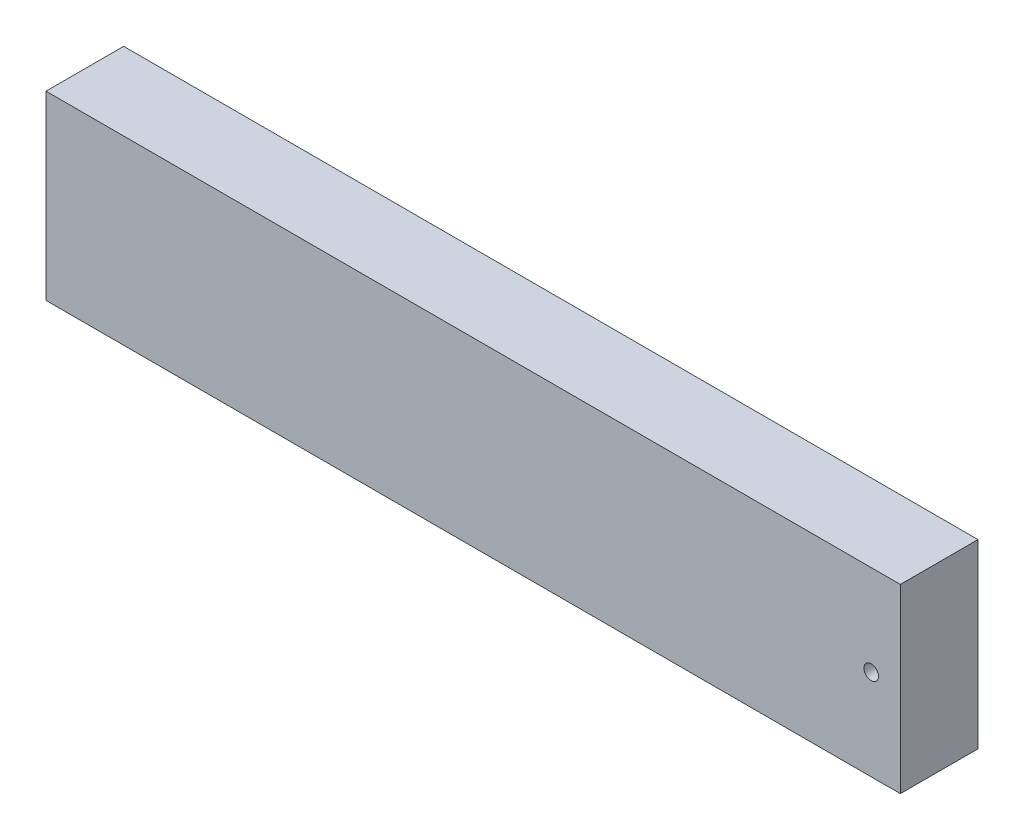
ISO-10303-21;
HEADER;
FILE_DESCRIPTION(('STEP AP214'),'2;1');
FILE_NAME('part.step','',(''),(''),'','','');
FILE_SCHEMA(('AUTOMOTIVE_DESIGN { 1 0 10303 214 1 1 1 1 }'));
ENDSEC;
DATA;
#1=APPLICATION_CONTEXT('core data for automotive mechanical design processes');
#2=APPLICATION_PROTOCOL_DEFINITION('international standard','automotive_design',2000,#1);
#3=PRODUCT_CONTEXT('',#1,'mechanical');
#4=PRODUCT('Part','Part','',(#3));
#5=PRODUCT_RELATED_PRODUCT_CATEGORY('part','',(#4));
#6=PRODUCT_DEFINITION_FORMATION('','',#4);
#7=PRODUCT_DEFINITION_CONTEXT('part definition',#1,'design');
#8=PRODUCT_DEFINITION('design','',#6,#7);
#9=PRODUCT_DEFINITION_SHAPE('','',#8);
#10=(LENGTH_UNIT() NAMED_UNIT(*) SI_UNIT(.MILLI.,.METRE.));
#11=(NAMED_UNIT(*) PLANE_ANGLE_UNIT() SI_UNIT($,.RADIAN.));
#12=(NAMED_UNIT(*) SI_UNIT($,.STERADIAN.) SOLID_ANGLE_UNIT());
#13=UNCERTAINTY_MEASURE_WITH_UNIT(LENGTH_MEASURE(1.E-05),#10,'distance_accuracy_value','');
#14=(GEOMETRIC_REPRESENTATION_CONTEXT(3) GLOBAL_UNCERTAINTY_ASSIGNED_CONTEXT((#13)) GLOBAL_UNIT_ASSIGNED_CONTEXT((#10,
#11,#12)) REPRESENTATION_CONTEXT('',''));
#15=CARTESIAN_POINT('',(0.,0.,0.));
#16=DIRECTION('',(0.,0.,1.));
#17=DIRECTION('',(1.,0.,0.));
#18=AXIS2_PLACEMENT_3D('',#15,#16,#17);
#19=CARTESIAN_POINT('',(419.1,0.,38.1));
#20=DIRECTION('',(0.,1.,0.));
#21=DIRECTION('',(-1.,0.,0.));
#22=AXIS2_PLACEMENT_3D('',#19,#20,#21);
#23=PLANE('',#22);
#24=DIRECTION('',(1.,0.,0.));
#25=VECTOR('',#24,1.);
#26=CARTESIAN_POINT('',(419.1,0.,0.));
#27=LINE('',#26,#25);
#28=CARTESIAN_POINT('',(0.,0.,0.));
#29=VERTEX_POINT('',#28);
#30=CARTESIAN_POINT('',(419.1,0.,0.));
#31=VERTEX_POINT('',#30);
#32=EDGE_CURVE('E95',#29,#31,#27,.T.);
#33=ORIENTED_EDGE('',*,*,#32,.T.);
#34=DIRECTION('',(0.,0.,-1.));
#35=VECTOR('',#34,1.);
#36=CARTESIAN_POINT('',(419.1,0.,38.1));
#37=LINE('',#36,#35);
#38=CARTESIAN_POINT('',(419.1,0.,38.1));
#39=VERTEX_POINT('',#38);
#40=EDGE_CURVE('E11',#39,#31,#37,.T.);
#41=ORIENTED_EDGE('',*,*,#40,.F.);
#42=DIRECTION('',(1.,0.,0.));
#43=VECTOR('',#42,1.);
#44=CARTESIAN_POINT('',(419.1,0.,38.1));
#45=LINE('',#44,#43);
#46=CARTESIAN_POINT('',(0.,0.,38.1));
#47=VERTEX_POINT('',#46);
#48=EDGE_CURVE('E83',#47,#39,#45,.T.);
#49=ORIENTED_EDGE('',*,*,#48,.F.);
#50=DIRECTION('',(0.,0.,-1.));
#51=VECTOR('',#50,1.);
#52=CARTESIAN_POINT('',(0.,0.,38.1));
#53=LINE('',#52,#51);
#54=EDGE_CURVE('E91',#47,#29,#53,.T.);
#55=ORIENTED_EDGE('',*,*,#54,.T.);
#56=EDGE_LOOP('',(#33,#41,#49,#55));
#57=FACE_BOUND('',#56,.T.);
#58=ADVANCED_FACE('F32',(#57),#23,.F.);
#59=CARTESIAN_POINT('',(419.1,88.9,38.1));
#60=DIRECTION('',(-1.,0.,0.));
#61=DIRECTION('',(0.,0.,1.));
#62=AXIS2_PLACEMENT_3D('',#59,#60,#61);
#63=PLANE('',#62);
#64=DIRECTION('',(0.,1.,0.));
#65=VECTOR('',#64,1.);
#66=CARTESIAN_POINT('',(419.1,88.9,0.));
#67=LINE('',#66,#65);
#68=CARTESIAN_POINT('',(419.1,88.9,0.));
#69=VERTEX_POINT('',#68);
#70=EDGE_CURVE('E87',#31,#69,#67,.T.);
#71=ORIENTED_EDGE('',*,*,#70,.T.);
#72=DIRECTION('',(0.,0.,-1.));
#73=VECTOR('',#72,1.);
#74=CARTESIAN_POINT('',(419.1,88.9,38.1));
#75=LINE('',#74,#73);
#76=CARTESIAN_POINT('',(419.1,88.9,38.1));
#77=VERTEX_POINT('',#76);
#78=EDGE_CURVE('E40',#77,#69,#75,.T.);
#79=ORIENTED_EDGE('',*,*,#78,.F.);
#80=DIRECTION('',(0.,1.,0.));
#81=VECTOR('',#80,1.);
#82=CARTESIAN_POINT('',(419.1,88.9,38.1));
#83=LINE('',#82,#81);
#84=EDGE_CURVE('E78',#39,#77,#83,.T.);
#85=ORIENTED_EDGE('',*,*,#84,.F.);
#86=ORIENTED_EDGE('',*,*,#40,.T.);
#87=EDGE_LOOP('',(#71,#79,#85,#86));
#88=FACE_BOUND('',#87,.T.);
#89=ADVANCED_FACE('F86',(#88),#63,.F.);
#90=CARTESIAN_POINT('',(0.,88.9,38.1));
#91=DIRECTION('',(0.,-1.,0.));
#92=DIRECTION('',(0.,0.,-1.));
#93=AXIS2_PLACEMENT_3D('',#90,#91,#92);
#94=PLANE('',#93);
#95=DIRECTION('',(-1.,0.,0.));
#96=VECTOR('',#95,1.);
#97=CARTESIAN_POINT('',(0.,88.9,0.));
#98=LINE('',#97,#96);
#99=CARTESIAN_POINT('',(0.,88.9,0.));
#100=VERTEX_POINT('',#99);
#101=EDGE_CURVE('E65',#69,#100,#98,.T.);
#102=ORIENTED_EDGE('',*,*,#101,.T.);
#103=DIRECTION('',(0.,0.,-1.));
#104=VECTOR('',#103,1.);
#105=CARTESIAN_POINT('',(0.,88.9,38.1));
#106=LINE('',#105,#104);
#107=CARTESIAN_POINT('',(0.,88.9,38.1));
#108=VERTEX_POINT('',#107);
#109=EDGE_CURVE('E88',#108,#100,#106,.T.);
#110=ORIENTED_EDGE('',*,*,#109,.F.);
#111=DIRECTION('',(-1.,0.,0.));
#112=VECTOR('',#111,1.);
#113=CARTESIAN_POINT('',(0.,88.9,38.1));
#114=LINE('',#113,#112);
#115=EDGE_CURVE('E81',#77,#108,#114,.T.);
#116=ORIENTED_EDGE('',*,*,#115,.F.);
#117=ORIENTED_EDGE('',*,*,#78,.T.);
#118=EDGE_LOOP('',(#102,#110,#116,#117));
#119=FACE_BOUND('',#118,.T.);
#120=ADVANCED_FACE('F89',(#119),#94,.F.);
#121=CARTESIAN_POINT('',(0.,0.,38.1));
#122=DIRECTION('',(1.,0.,0.));
#123=DIRECTION('',(0.,0.,-1.));
#124=AXIS2_PLACEMENT_3D('',#121,#122,#123);
#125=PLANE('',#124);
#126=DIRECTION('',(0.,-1.,0.));
#127=VECTOR('',#126,1.);
#128=CARTESIAN_POINT('',(0.,0.,0.));
#129=LINE('',#128,#127);
#130=EDGE_CURVE('E71',#100,#29,#129,.T.);
#131=ORIENTED_EDGE('',*,*,#130,.T.);
#132=ORIENTED_EDGE('',*,*,#54,.F.);
#133=DIRECTION('',(0.,-1.,0.));
#134=VECTOR('',#133,1.);
#135=CARTESIAN_POINT('',(0.,0.,38.1));
#136=LINE('',#135,#134);
#137=EDGE_CURVE('E48',#108,#47,#136,.T.);
#138=ORIENTED_EDGE('',*,*,#137,.F.);
#139=ORIENTED_EDGE('',*,*,#109,.T.);
#140=EDGE_LOOP('',(#131,#132,#138,#139));
#141=FACE_BOUND('',#140,.T.);
#142=ADVANCED_FACE('F103',(#141),#125,.F.);
#143=CARTESIAN_POINT('',(0.,0.,38.1));
#144=DIRECTION('',(0.,0.,-1.));
#145=DIRECTION('',(-1.,0.,0.));
#146=AXIS2_PLACEMENT_3D('',#143,#144,#145);
#147=PLANE('',#146);
#148=CARTESIAN_POINT('',(404.8125,44.45,38.1));
#149=DIRECTION('',(0.,0.,1.));
#150=DIRECTION('',(1.,0.,0.));
#151=AXIS2_PLACEMENT_3D('',#148,#149,#150);
#152=CIRCLE('',#151,3.571875);
#153=CARTESIAN_POINT('',(408.384375,44.45,38.1));
#154=VERTEX_POINT('',#153);
#155=EDGE_CURVE('E111',#154,#154,#152,.T.);
#156=ORIENTED_EDGE('',*,*,#155,.F.);
#157=EDGE_LOOP('',(#156));
#158=FACE_BOUND('',#157,.T.);
#159=ORIENTED_EDGE('',*,*,#48,.T.);
#160=ORIENTED_EDGE('',*,*,#84,.T.);
#161=ORIENTED_EDGE('',*,*,#115,.T.);
#162=ORIENTED_EDGE('',*,*,#137,.T.);
#163=EDGE_LOOP('',(#159,#160,#161,#162));
#164=FACE_BOUND('',#163,.T.);
#165=ADVANCED_FACE('F79',(#158,#164),#147,.F.);
#166=CARTESIAN_POINT('',(0.,0.,0.));
#167=DIRECTION('',(0.,0.,-1.));
#168=DIRECTION('',(-1.,0.,0.));
#169=AXIS2_PLACEMENT_3D('',#166,#167,#168);
#170=PLANE('',#169);
#171=CARTESIAN_POINT('',(404.8125,44.45,0.));
#172=DIRECTION('',(0.,0.,1.));
#173=DIRECTION('',(1.,0.,0.));
#174=AXIS2_PLACEMENT_3D('',#171,#172,#173);
#175=CIRCLE('',#174,3.571875);
#176=CARTESIAN_POINT('',(408.384375,44.45,0.));
#177=VERTEX_POINT('',#176);
#178=EDGE_CURVE('E98',#177,#177,#175,.T.);
#179=ORIENTED_EDGE('',*,*,#178,.T.);
#180=EDGE_LOOP('',(#179));
#181=FACE_BOUND('',#180,.T.);
#182=ORIENTED_EDGE('',*,*,#32,.F.);
#183=ORIENTED_EDGE('',*,*,#130,.F.);
#184=ORIENTED_EDGE('',*,*,#101,.F.);
#185=ORIENTED_EDGE('',*,*,#70,.F.);
#186=EDGE_LOOP('',(#182,#183,#184,#185));
#187=FACE_BOUND('',#186,.T.);
#188=ADVANCED_FACE('F106',(#181,#187),#170,.T.);
#189=CARTESIAN_POINT('',(404.8125,44.45,38.1));
#190=DIRECTION('',(0.,0.,1.));
#191=DIRECTION('',(1.,0.,0.));
#192=AXIS2_PLACEMENT_3D('',#189,#190,#191);
#193=CYLINDRICAL_SURFACE('',#192,3.571875);
#194=ORIENTED_EDGE('',*,*,#178,.F.);
#195=EDGE_LOOP('',(#194));
#196=FACE_BOUND('',#195,.T.);
#197=ORIENTED_EDGE('',*,*,#155,.T.);
#198=EDGE_LOOP('',(#197));
#199=FACE_BOUND('',#198,.T.);
#200=ADVANCED_FACE('F115',(#196,#199),#193,.F.);
#201=CLOSED_SHELL('',(#58,#89,#120,#142,#165,#188,#200));
#202=MANIFOLD_SOLID_BREP('B2',#201);
#203=ADVANCED_BREP_SHAPE_REPRESENTATION('',(#18,#202),#14);
#204=SHAPE_DEFINITION_REPRESENTATION(#9,#203);
ENDSEC;
END-ISO-10303-21;
